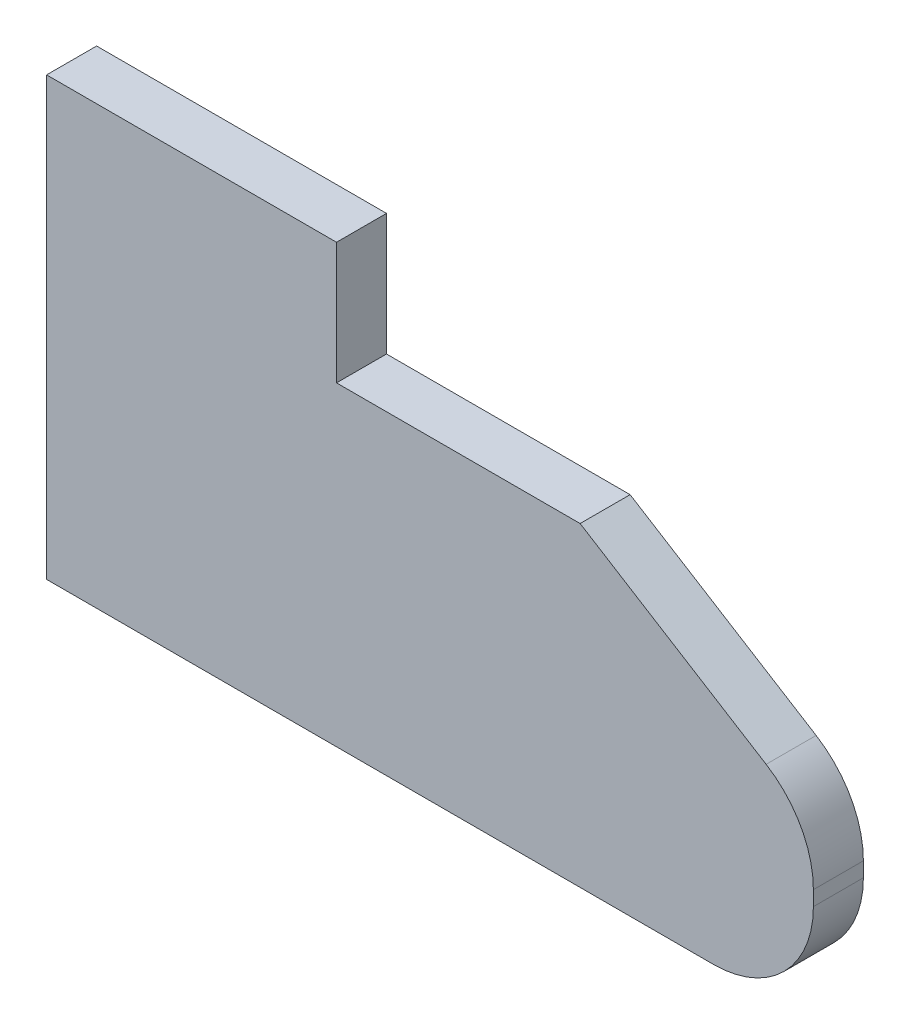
ISO-10303-21;
HEADER;
FILE_DESCRIPTION(('STEP AP214'),'2;1');
FILE_NAME('part.step','',(''),(''),'','','');
FILE_SCHEMA(('AUTOMOTIVE_DESIGN { 1 0 10303 214 1 1 1 1 }'));
ENDSEC;
DATA;
#1=APPLICATION_CONTEXT('core data for automotive mechanical design processes');
#2=APPLICATION_PROTOCOL_DEFINITION('international standard','automotive_design',2000,#1);
#3=PRODUCT_CONTEXT('',#1,'mechanical');
#4=PRODUCT('Part','Part','',(#3));
#5=PRODUCT_RELATED_PRODUCT_CATEGORY('part','',(#4));
#6=PRODUCT_DEFINITION_FORMATION('','',#4);
#7=PRODUCT_DEFINITION_CONTEXT('part definition',#1,'design');
#8=PRODUCT_DEFINITION('design','',#6,#7);
#9=PRODUCT_DEFINITION_SHAPE('','',#8);
#10=(LENGTH_UNIT() NAMED_UNIT(*) SI_UNIT(.MILLI.,.METRE.));
#11=(NAMED_UNIT(*) PLANE_ANGLE_UNIT() SI_UNIT($,.RADIAN.));
#12=(NAMED_UNIT(*) SI_UNIT($,.STERADIAN.) SOLID_ANGLE_UNIT());
#13=UNCERTAINTY_MEASURE_WITH_UNIT(LENGTH_MEASURE(1.E-05),#10,'distance_accuracy_value','');
#14=(GEOMETRIC_REPRESENTATION_CONTEXT(3) GLOBAL_UNCERTAINTY_ASSIGNED_CONTEXT((#13)) GLOBAL_UNIT_ASSIGNED_CONTEXT((#10,
#11,#12)) REPRESENTATION_CONTEXT('',''));
#15=CARTESIAN_POINT('',(0.,0.,0.));
#16=DIRECTION('',(0.,0.,1.));
#17=DIRECTION('',(1.,0.,0.));
#18=AXIS2_PLACEMENT_3D('',#15,#16,#17);
#19=CARTESIAN_POINT('',(0.,0.,5.));
#20=DIRECTION('',(1.,0.,0.));
#21=DIRECTION('',(0.,0.,-1.));
#22=AXIS2_PLACEMENT_3D('',#19,#20,#21);
#23=PLANE('',#22);
#24=DIRECTION('',(0.,-1.,0.));
#25=VECTOR('',#24,1.);
#26=CARTESIAN_POINT('',(0.,0.,0.));
#27=LINE('',#26,#25);
#28=CARTESIAN_POINT('',(0.,43.6956390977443,0.));
#29=VERTEX_POINT('',#28);
#30=CARTESIAN_POINT('',(0.,0.,0.));
#31=VERTEX_POINT('',#30);
#32=EDGE_CURVE('E107',#29,#31,#27,.T.);
#33=ORIENTED_EDGE('',*,*,#32,.T.);
#34=DIRECTION('',(0.,0.,-1.));
#35=VECTOR('',#34,1.);
#36=CARTESIAN_POINT('',(0.,0.,5.));
#37=LINE('',#36,#35);
#38=CARTESIAN_POINT('',(0.,0.,5.));
#39=VERTEX_POINT('',#38);
#40=EDGE_CURVE('E11',#39,#31,#37,.T.);
#41=ORIENTED_EDGE('',*,*,#40,.F.);
#42=DIRECTION('',(0.,-1.,0.));
#43=VECTOR('',#42,1.);
#44=CARTESIAN_POINT('',(0.,0.,5.));
#45=LINE('',#44,#43);
#46=CARTESIAN_POINT('',(0.,43.6956390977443,5.));
#47=VERTEX_POINT('',#46);
#48=EDGE_CURVE('E136',#47,#39,#45,.T.);
#49=ORIENTED_EDGE('',*,*,#48,.F.);
#50=DIRECTION('',(0.,0.,-1.));
#51=VECTOR('',#50,1.);
#52=CARTESIAN_POINT('',(0.,43.6956390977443,5.));
#53=LINE('',#52,#51);
#54=EDGE_CURVE('E120',#47,#29,#53,.T.);
#55=ORIENTED_EDGE('',*,*,#54,.T.);
#56=EDGE_LOOP('',(#33,#41,#49,#55));
#57=FACE_BOUND('',#56,.T.);
#58=ADVANCED_FACE('F33',(#57),#23,.F.);
#59=CARTESIAN_POINT('',(0.,0.,5.));
#60=DIRECTION('',(0.,1.,0.));
#61=DIRECTION('',(0.,0.,1.));
#62=AXIS2_PLACEMENT_3D('',#59,#60,#61);
#63=PLANE('',#62);
#64=DIRECTION('',(1.,0.,0.));
#65=VECTOR('',#64,1.);
#66=CARTESIAN_POINT('',(0.,0.,0.));
#67=LINE('',#66,#65);
#68=CARTESIAN_POINT('',(66.6774436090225,0.,0.));
#69=VERTEX_POINT('',#68);
#70=EDGE_CURVE('E103',#31,#69,#67,.T.);
#71=ORIENTED_EDGE('',*,*,#70,.T.);
#72=DIRECTION('',(0.,0.,-1.));
#73=VECTOR('',#72,1.);
#74=CARTESIAN_POINT('',(66.6774436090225,0.,5.));
#75=LINE('',#74,#73);
#76=CARTESIAN_POINT('',(66.6774436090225,0.,5.));
#77=VERTEX_POINT('',#76);
#78=EDGE_CURVE('E40',#77,#69,#75,.T.);
#79=ORIENTED_EDGE('',*,*,#78,.F.);
#80=DIRECTION('',(1.,0.,0.));
#81=VECTOR('',#80,1.);
#82=CARTESIAN_POINT('',(0.,0.,5.));
#83=LINE('',#82,#81);
#84=EDGE_CURVE('E116',#39,#77,#83,.T.);
#85=ORIENTED_EDGE('',*,*,#84,.F.);
#86=ORIENTED_EDGE('',*,*,#40,.T.);
#87=EDGE_LOOP('',(#71,#79,#85,#86));
#88=FACE_BOUND('',#87,.T.);
#89=ADVANCED_FACE('F115',(#88),#63,.F.);
#90=CARTESIAN_POINT('',(66.6774436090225,10.,5.));
#91=DIRECTION('',(0.,0.,-1.));
#92=DIRECTION('',(-1.,0.,0.));
#93=AXIS2_PLACEMENT_3D('',#90,#91,#92);
#94=CYLINDRICAL_SURFACE('',#93,10.);
#95=CARTESIAN_POINT('',(66.6774436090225,10.,0.));
#96=DIRECTION('',(0.,0.,1.));
#97=DIRECTION('',(1.,0.,0.));
#98=AXIS2_PLACEMENT_3D('',#95,#96,#97);
#99=CIRCLE('',#98,10.);
#100=CARTESIAN_POINT('',(76.6774436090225,10.0000000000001,0.));
#101=VERTEX_POINT('',#100);
#102=EDGE_CURVE('E109',#69,#101,#99,.T.);
#103=ORIENTED_EDGE('',*,*,#102,.T.);
#104=DIRECTION('',(0.,0.,-1.));
#105=VECTOR('',#104,1.);
#106=CARTESIAN_POINT('',(76.6774436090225,10.0000000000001,5.));
#107=LINE('',#106,#105);
#108=CARTESIAN_POINT('',(76.6774436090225,10.0000000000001,5.));
#109=VERTEX_POINT('',#108);
#110=EDGE_CURVE('E167',#109,#101,#107,.T.);
#111=ORIENTED_EDGE('',*,*,#110,.F.);
#112=CARTESIAN_POINT('',(66.6774436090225,10.,5.));
#113=DIRECTION('',(0.,0.,1.));
#114=DIRECTION('',(1.,0.,0.));
#115=AXIS2_PLACEMENT_3D('',#112,#113,#114);
#116=CIRCLE('',#115,10.);
#117=EDGE_CURVE('E139',#77,#109,#116,.T.);
#118=ORIENTED_EDGE('',*,*,#117,.F.);
#119=ORIENTED_EDGE('',*,*,#78,.T.);
#120=EDGE_LOOP('',(#103,#111,#118,#119));
#121=FACE_BOUND('',#120,.T.);
#122=ADVANCED_FACE('F171',(#121),#94,.T.);
#123=CARTESIAN_POINT('',(76.6774436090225,10.0000000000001,5.));
#124=DIRECTION('',(-1.,0.,0.));
#125=DIRECTION('',(0.,0.,1.));
#126=AXIS2_PLACEMENT_3D('',#123,#124,#125);
#127=PLANE('',#126);
#128=DIRECTION('',(0.,1.,0.));
#129=VECTOR('',#128,1.);
#130=CARTESIAN_POINT('',(76.6774436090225,10.0000000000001,0.));
#131=LINE('',#130,#129);
#132=CARTESIAN_POINT('',(76.6774436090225,11.4704480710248,0.));
#133=VERTEX_POINT('',#132);
#134=EDGE_CURVE('E124',#101,#133,#131,.T.);
#135=ORIENTED_EDGE('',*,*,#134,.T.);
#136=DIRECTION('',(0.,0.,-1.));
#137=VECTOR('',#136,1.);
#138=CARTESIAN_POINT('',(76.6774436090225,11.4704480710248,5.));
#139=LINE('',#138,#137);
#140=CARTESIAN_POINT('',(76.6774436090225,11.4704480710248,5.));
#141=VERTEX_POINT('',#140);
#142=EDGE_CURVE('E164',#141,#133,#139,.T.);
#143=ORIENTED_EDGE('',*,*,#142,.F.);
#144=DIRECTION('',(0.,1.,0.));
#145=VECTOR('',#144,1.);
#146=CARTESIAN_POINT('',(76.6774436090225,10.0000000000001,5.));
#147=LINE('',#146,#145);
#148=EDGE_CURVE('E141',#109,#141,#147,.T.);
#149=ORIENTED_EDGE('',*,*,#148,.F.);
#150=ORIENTED_EDGE('',*,*,#110,.T.);
#151=EDGE_LOOP('',(#135,#143,#149,#150));
#152=FACE_BOUND('',#151,.T.);
#153=ADVANCED_FACE('F179',(#152),#127,.F.);
#154=CARTESIAN_POINT('',(66.6774436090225,11.4704480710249,5.));
#155=DIRECTION('',(0.,0.,-1.));
#156=DIRECTION('',(-1.,0.,0.));
#157=AXIS2_PLACEMENT_3D('',#154,#155,#156);
#158=CYLINDRICAL_SURFACE('',#157,10.);
#159=CARTESIAN_POINT('',(66.6774436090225,11.4704480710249,0.));
#160=DIRECTION('',(0.,0.,1.));
#161=DIRECTION('',(-1.,0.,0.));
#162=AXIS2_PLACEMENT_3D('',#159,#160,#161);
#163=CIRCLE('',#162,10.);
#164=CARTESIAN_POINT('',(71.9527670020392,19.9657975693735,0.));
#165=VERTEX_POINT('',#164);
#166=EDGE_CURVE('E126',#133,#165,#163,.T.);
#167=ORIENTED_EDGE('',*,*,#166,.T.);
#168=DIRECTION('',(0.,0.,-1.));
#169=VECTOR('',#168,1.);
#170=CARTESIAN_POINT('',(71.9527670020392,19.9657975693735,5.));
#171=LINE('',#170,#169);
#172=CARTESIAN_POINT('',(71.9527670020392,19.9657975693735,5.));
#173=VERTEX_POINT('',#172);
#174=EDGE_CURVE('E161',#173,#165,#171,.T.);
#175=ORIENTED_EDGE('',*,*,#174,.F.);
#176=CARTESIAN_POINT('',(66.6774436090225,11.4704480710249,5.));
#177=DIRECTION('',(0.,0.,1.));
#178=DIRECTION('',(-1.,0.,0.));
#179=AXIS2_PLACEMENT_3D('',#176,#177,#178);
#180=CIRCLE('',#179,10.);
#181=EDGE_CURVE('E143',#141,#173,#180,.T.);
#182=ORIENTED_EDGE('',*,*,#181,.F.);
#183=ORIENTED_EDGE('',*,*,#142,.T.);
#184=EDGE_LOOP('',(#167,#175,#182,#183));
#185=FACE_BOUND('',#184,.T.);
#186=ADVANCED_FACE('F182',(#185),#158,.T.);
#187=CARTESIAN_POINT('',(53.3509819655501,31.5168740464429,5.));
#188=DIRECTION('',(-0.527532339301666,-0.849534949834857,0.));
#189=DIRECTION('',(0.849534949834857,-0.527532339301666,0.));
#190=AXIS2_PLACEMENT_3D('',#187,#188,#189);
#191=PLANE('',#190);
#192=DIRECTION('',(-0.849534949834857,0.527532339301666,0.));
#193=VECTOR('',#192,1.);
#194=CARTESIAN_POINT('',(53.3509819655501,31.5168740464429,0.));
#195=LINE('',#194,#193);
#196=CARTESIAN_POINT('',(53.3509819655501,31.5168740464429,0.));
#197=VERTEX_POINT('',#196);
#198=EDGE_CURVE('E128',#165,#197,#195,.T.);
#199=ORIENTED_EDGE('',*,*,#198,.T.);
#200=DIRECTION('',(0.,0.,-1.));
#201=VECTOR('',#200,1.);
#202=CARTESIAN_POINT('',(53.3509819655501,31.5168740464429,5.));
#203=LINE('',#202,#201);
#204=CARTESIAN_POINT('',(53.3509819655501,31.5168740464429,5.));
#205=VERTEX_POINT('',#204);
#206=EDGE_CURVE('E158',#205,#197,#203,.T.);
#207=ORIENTED_EDGE('',*,*,#206,.F.);
#208=DIRECTION('',(-0.849534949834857,0.527532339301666,0.));
#209=VECTOR('',#208,1.);
#210=CARTESIAN_POINT('',(53.3509819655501,31.5168740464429,5.));
#211=LINE('',#210,#209);
#212=EDGE_CURVE('E145',#173,#205,#211,.T.);
#213=ORIENTED_EDGE('',*,*,#212,.F.);
#214=ORIENTED_EDGE('',*,*,#174,.T.);
#215=EDGE_LOOP('',(#199,#207,#213,#214));
#216=FACE_BOUND('',#215,.T.);
#217=ADVANCED_FACE('F187',(#216),#191,.F.);
#218=CARTESIAN_POINT('',(28.9899463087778,31.5168740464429,5.));
#219=DIRECTION('',(0.,-1.,0.));
#220=DIRECTION('',(0.,0.,-1.));
#221=AXIS2_PLACEMENT_3D('',#218,#219,#220);
#222=PLANE('',#221);
#223=DIRECTION('',(-1.,0.,0.));
#224=VECTOR('',#223,1.);
#225=CARTESIAN_POINT('',(28.9899463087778,31.5168740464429,0.));
#226=LINE('',#225,#224);
#227=CARTESIAN_POINT('',(28.9899463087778,31.5168740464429,0.));
#228=VERTEX_POINT('',#227);
#229=EDGE_CURVE('E130',#197,#228,#226,.T.);
#230=ORIENTED_EDGE('',*,*,#229,.T.);
#231=DIRECTION('',(0.,0.,-1.));
#232=VECTOR('',#231,1.);
#233=CARTESIAN_POINT('',(28.9899463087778,31.5168740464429,5.));
#234=LINE('',#233,#232);
#235=CARTESIAN_POINT('',(28.9899463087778,31.5168740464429,5.));
#236=VERTEX_POINT('',#235);
#237=EDGE_CURVE('E155',#236,#228,#234,.T.);
#238=ORIENTED_EDGE('',*,*,#237,.F.);
#239=DIRECTION('',(-1.,0.,0.));
#240=VECTOR('',#239,1.);
#241=CARTESIAN_POINT('',(28.9899463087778,31.5168740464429,5.));
#242=LINE('',#241,#240);
#243=EDGE_CURVE('E147',#205,#236,#242,.T.);
#244=ORIENTED_EDGE('',*,*,#243,.F.);
#245=ORIENTED_EDGE('',*,*,#206,.T.);
#246=EDGE_LOOP('',(#230,#238,#244,#245));
#247=FACE_BOUND('',#246,.T.);
#248=ADVANCED_FACE('F191',(#247),#222,.F.);
#249=CARTESIAN_POINT('',(28.9899463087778,43.6956390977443,5.));
#250=DIRECTION('',(-1.,0.,0.));
#251=DIRECTION('',(0.,0.,1.));
#252=AXIS2_PLACEMENT_3D('',#249,#250,#251);
#253=PLANE('',#252);
#254=DIRECTION('',(0.,1.,0.));
#255=VECTOR('',#254,1.);
#256=CARTESIAN_POINT('',(28.9899463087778,43.6956390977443,0.));
#257=LINE('',#256,#255);
#258=CARTESIAN_POINT('',(28.9899463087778,43.6956390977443,0.));
#259=VERTEX_POINT('',#258);
#260=EDGE_CURVE('E132',#228,#259,#257,.T.);
#261=ORIENTED_EDGE('',*,*,#260,.T.);
#262=DIRECTION('',(0.,0.,-1.));
#263=VECTOR('',#262,1.);
#264=CARTESIAN_POINT('',(28.9899463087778,43.6956390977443,5.));
#265=LINE('',#264,#263);
#266=CARTESIAN_POINT('',(28.9899463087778,43.6956390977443,5.));
#267=VERTEX_POINT('',#266);
#268=EDGE_CURVE('E152',#267,#259,#265,.T.);
#269=ORIENTED_EDGE('',*,*,#268,.F.);
#270=DIRECTION('',(0.,1.,0.));
#271=VECTOR('',#270,1.);
#272=CARTESIAN_POINT('',(28.9899463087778,43.6956390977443,5.));
#273=LINE('',#272,#271);
#274=EDGE_CURVE('E52',#236,#267,#273,.T.);
#275=ORIENTED_EDGE('',*,*,#274,.F.);
#276=ORIENTED_EDGE('',*,*,#237,.T.);
#277=EDGE_LOOP('',(#261,#269,#275,#276));
#278=FACE_BOUND('',#277,.T.);
#279=ADVANCED_FACE('F195',(#278),#253,.F.);
#280=CARTESIAN_POINT('',(0.,43.6956390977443,5.));
#281=DIRECTION('',(0.,-1.,0.));
#282=DIRECTION('',(0.,0.,-1.));
#283=AXIS2_PLACEMENT_3D('',#280,#281,#282);
#284=PLANE('',#283);
#285=DIRECTION('',(-1.,0.,0.));
#286=VECTOR('',#285,1.);
#287=CARTESIAN_POINT('',(0.,43.6956390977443,0.));
#288=LINE('',#287,#286);
#289=EDGE_CURVE('E134',#259,#29,#288,.T.);
#290=ORIENTED_EDGE('',*,*,#289,.T.);
#291=ORIENTED_EDGE('',*,*,#54,.F.);
#292=DIRECTION('',(-1.,0.,0.));
#293=VECTOR('',#292,1.);
#294=CARTESIAN_POINT('',(0.,43.6956390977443,5.));
#295=LINE('',#294,#293);
#296=EDGE_CURVE('E47',#267,#47,#295,.T.);
#297=ORIENTED_EDGE('',*,*,#296,.F.);
#298=ORIENTED_EDGE('',*,*,#268,.T.);
#299=EDGE_LOOP('',(#290,#291,#297,#298));
#300=FACE_BOUND('',#299,.T.);
#301=ADVANCED_FACE('F197',(#300),#284,.F.);
#302=CARTESIAN_POINT('',(66.6774436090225,11.4704480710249,5.));
#303=DIRECTION('',(0.,0.,-1.));
#304=DIRECTION('',(-1.,0.,0.));
#305=AXIS2_PLACEMENT_3D('',#302,#303,#304);
#306=PLANE('',#305);
#307=ORIENTED_EDGE('',*,*,#48,.T.);
#308=ORIENTED_EDGE('',*,*,#84,.T.);
#309=ORIENTED_EDGE('',*,*,#117,.T.);
#310=ORIENTED_EDGE('',*,*,#148,.T.);
#311=ORIENTED_EDGE('',*,*,#181,.T.);
#312=ORIENTED_EDGE('',*,*,#212,.T.);
#313=ORIENTED_EDGE('',*,*,#243,.T.);
#314=ORIENTED_EDGE('',*,*,#274,.T.);
#315=ORIENTED_EDGE('',*,*,#296,.T.);
#316=EDGE_LOOP('',(#307,#308,#309,#310,#311,#312,#313,#314,#315));
#317=FACE_BOUND('',#316,.T.);
#318=ADVANCED_FACE('F174',(#317),#306,.F.);
#319=CARTESIAN_POINT('',(66.6774436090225,11.4704480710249,0.));
#320=DIRECTION('',(0.,0.,-1.));
#321=DIRECTION('',(-1.,0.,0.));
#322=AXIS2_PLACEMENT_3D('',#319,#320,#321);
#323=PLANE('',#322);
#324=ORIENTED_EDGE('',*,*,#32,.F.);
#325=ORIENTED_EDGE('',*,*,#289,.F.);
#326=ORIENTED_EDGE('',*,*,#260,.F.);
#327=ORIENTED_EDGE('',*,*,#229,.F.);
#328=ORIENTED_EDGE('',*,*,#198,.F.);
#329=ORIENTED_EDGE('',*,*,#166,.F.);
#330=ORIENTED_EDGE('',*,*,#134,.F.);
#331=ORIENTED_EDGE('',*,*,#102,.F.);
#332=ORIENTED_EDGE('',*,*,#70,.F.);
#333=EDGE_LOOP('',(#324,#325,#326,#327,#328,#329,#330,#331,#332));
#334=FACE_BOUND('',#333,.T.);
#335=ADVANCED_FACE('F104',(#334),#323,.T.);
#336=CLOSED_SHELL('',(#58,#89,#122,#153,#186,#217,#248,#279,#301,#318,#335));
#337=MANIFOLD_SOLID_BREP('B2',#336);
#338=ADVANCED_BREP_SHAPE_REPRESENTATION('',(#18,#337),#14);
#339=SHAPE_DEFINITION_REPRESENTATION(#9,#338);
ENDSEC;
END-ISO-10303-21;
